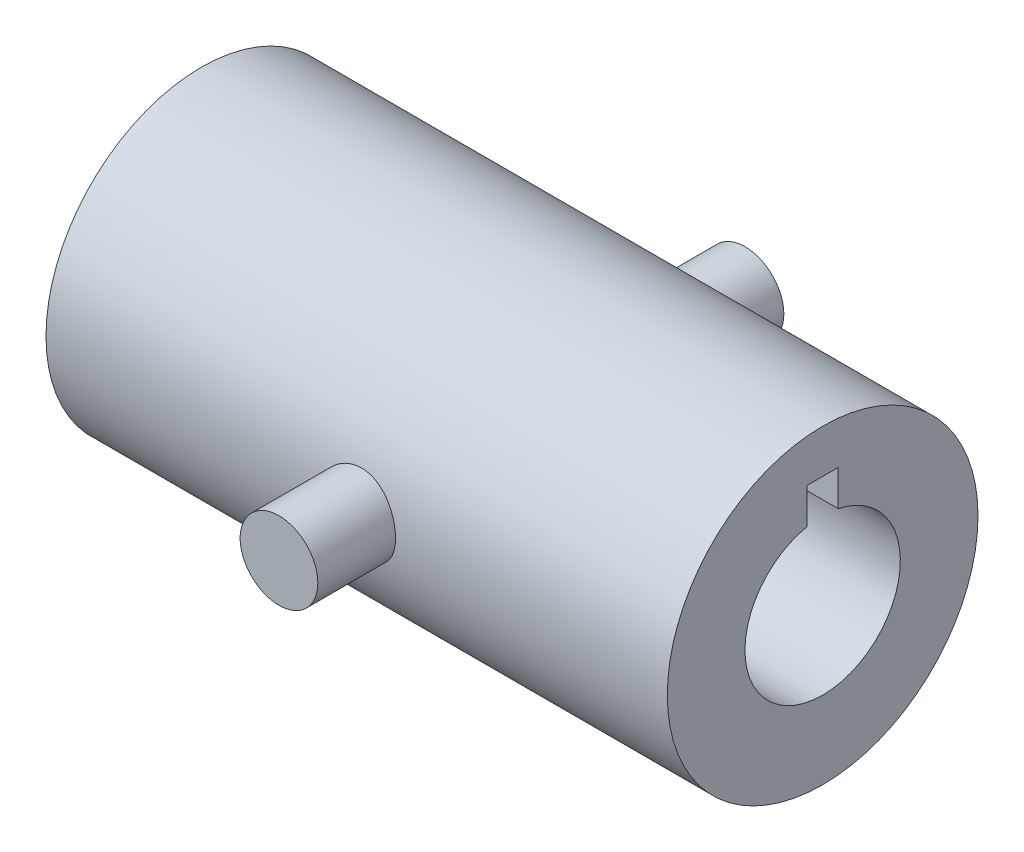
ISO-10303-21;
HEADER;
FILE_DESCRIPTION(('STEP AP214'),'2;1');
FILE_NAME('part.step','',(''),(''),'','','');
FILE_SCHEMA(('AUTOMOTIVE_DESIGN { 1 0 10303 214 1 1 1 1 }'));
ENDSEC;
DATA;
#1=APPLICATION_CONTEXT('core data for automotive mechanical design processes');
#2=APPLICATION_PROTOCOL_DEFINITION('international standard','automotive_design',2000,#1);
#3=PRODUCT_CONTEXT('',#1,'mechanical');
#4=PRODUCT('Part','Part','',(#3));
#5=PRODUCT_RELATED_PRODUCT_CATEGORY('part','',(#4));
#6=PRODUCT_DEFINITION_FORMATION('','',#4);
#7=PRODUCT_DEFINITION_CONTEXT('part definition',#1,'design');
#8=PRODUCT_DEFINITION('design','',#6,#7);
#9=PRODUCT_DEFINITION_SHAPE('','',#8);
#10=(LENGTH_UNIT() NAMED_UNIT(*) SI_UNIT(.MILLI.,.METRE.));
#11=(NAMED_UNIT(*) PLANE_ANGLE_UNIT() SI_UNIT($,.RADIAN.));
#12=(NAMED_UNIT(*) SI_UNIT($,.STERADIAN.) SOLID_ANGLE_UNIT());
#13=UNCERTAINTY_MEASURE_WITH_UNIT(LENGTH_MEASURE(1.E-05),#10,'distance_accuracy_value','');
#14=(GEOMETRIC_REPRESENTATION_CONTEXT(3) GLOBAL_UNCERTAINTY_ASSIGNED_CONTEXT((#13)) GLOBAL_UNIT_ASSIGNED_CONTEXT((#10,
#11,#12)) REPRESENTATION_CONTEXT('',''));
#15=CARTESIAN_POINT('',(0.,0.,0.));
#16=DIRECTION('',(0.,0.,1.));
#17=DIRECTION('',(1.,0.,0.));
#18=AXIS2_PLACEMENT_3D('',#15,#16,#17);
#19=CARTESIAN_POINT('',(12912.4668219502,5713.18508240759,-41.8213637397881));
#20=DIRECTION('',(-5.67598126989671E-05,-1.88587533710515E-05,0.999999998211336));
#21=DIRECTION('',(0.999999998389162,0.,5.67598127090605E-05));
#22=AXIS2_PLACEMENT_3D('',#19,#20,#21);
#23=PLANE('',#22);
#24=CARTESIAN_POINT('',(12909.2918221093,5713.18607137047,-41.8215439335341));
#25=DIRECTION('',(-5.67598127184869E-05,-1.8858753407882E-05,0.999999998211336));
#26=DIRECTION('',(0.999999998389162,0.,5.67598127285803E-05));
#27=AXIS2_PLACEMENT_3D('',#24,#25,#26);
#28=CIRCLE('',#27,3.17500000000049);
#29=CARTESIAN_POINT('',(12912.4668221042,5713.18607137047,-41.8213637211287));
#30=VERTEX_POINT('',#29);
#31=EDGE_CURVE('E39',#30,#30,#28,.T.);
#32=ORIENTED_EDGE('',*,*,#31,.F.);
#33=EDGE_LOOP('',(#32));
#34=FACE_BOUND('',#33,.T.);
#35=ADVANCED_FACE('F34',(#34),#23,.F.);
#36=CARTESIAN_POINT('',(12909.2918221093,5713.18607137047,-41.8215439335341));
#37=DIRECTION('',(-5.67598127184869E-05,-1.8858753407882E-05,0.999999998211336));
#38=DIRECTION('',(0.999999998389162,0.,5.67598127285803E-05));
#39=AXIS2_PLACEMENT_3D('',#36,#37,#38);
#40=CYLINDRICAL_SURFACE('',#39,3.17500000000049);
#41=CARTESIAN_POINT('',(12912.4664615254,5713.18496265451,-35.4713637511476));
#42=CARTESIAN_POINT('',(12912.4665085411,5713.36032179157,-35.4713559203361));
#43=CARTESIAN_POINT('',(12912.4519887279,5713.53578583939,-35.467688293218));
#44=CARTESIAN_POINT('',(12912.3942525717,5713.88174267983,-35.4534124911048));
#45=CARTESIAN_POINT('',(12912.3510083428,5714.05223047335,-35.4427975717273));
#46=CARTESIAN_POINT('',(12912.2372992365,5714.38311564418,-35.4158042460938));
#47=CARTESIAN_POINT('',(12912.166871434,5714.54352642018,-35.3994336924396));
#48=CARTESIAN_POINT('',(12912.0009154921,5714.85024110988,-35.3626735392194));
#49=CARTESIAN_POINT('',(12911.9053885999,5714.99654572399,-35.3422841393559));
#50=CARTESIAN_POINT('',(12911.6898614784,5715.27393102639,-35.2992288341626));
#51=CARTESIAN_POINT('',(12911.5694406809,5715.40467950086,-35.2765277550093));
#52=CARTESIAN_POINT('',(12911.3084420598,5715.64435269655,-35.2316417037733));
#53=CARTESIAN_POINT('',(12911.1678616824,5715.75327464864,-35.2094567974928));
#54=CARTESIAN_POINT('',(12910.8679613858,5715.94776124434,-35.167761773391));
#55=CARTESIAN_POINT('',(12910.7083941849,5716.03295501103,-35.1482962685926));
#56=CARTESIAN_POINT('',(12910.3766380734,5716.17518059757,-35.1147569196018));
#57=CARTESIAN_POINT('',(12910.2044512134,5716.23221698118,-35.1006822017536));
#58=CARTESIAN_POINT('',(12909.8559906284,5716.31537624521,-35.0798796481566));
#59=CARTESIAN_POINT('',(12909.6798678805,5716.34209553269,-35.0730102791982));
#60=CARTESIAN_POINT('',(12909.3255159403,5716.36572095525,-35.0669735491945));
#61=CARTESIAN_POINT('',(12909.1472870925,5716.362631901,-35.0678049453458));
#62=CARTESIAN_POINT('',(12908.7983547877,5716.32720278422,-35.0769491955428));
#63=CARTESIAN_POINT('',(12908.6275736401,5716.29557362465,-35.0850801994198));
#64=CARTESIAN_POINT('',(12908.2938215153,5716.20509719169,-35.107618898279));
#65=CARTESIAN_POINT('',(12908.1308511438,5716.14624781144,-35.1220270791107));
#66=CARTESIAN_POINT('',(12907.81543686,5716.00239423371,-35.1556650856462));
#67=CARTESIAN_POINT('',(12907.6631162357,5715.91713125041,-35.1749422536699));
#68=CARTESIAN_POINT('',(12907.3747002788,5715.72305727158,-35.2161185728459));
#69=CARTESIAN_POINT('',(12907.2386067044,5715.6142437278,-35.23801800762));
#70=CARTESIAN_POINT('',(12906.9824435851,5715.37249676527,-35.2827353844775));
#71=CARTESIAN_POINT('',(12906.8629375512,5715.23896711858,-35.3055617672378));
#72=CARTESIAN_POINT('',(12906.6478582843,5714.9534265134,-35.3490119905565));
#73=CARTESIAN_POINT('',(12906.5522953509,5714.80140764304,-35.3696348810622));
#74=CARTESIAN_POINT('',(12906.3876099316,5714.48235689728,-35.406460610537));
#75=CARTESIAN_POINT('',(12906.3185999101,5714.31526478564,-35.4226445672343));
#76=CARTESIAN_POINT('',(12906.2099349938,5713.97156011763,-35.4486068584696));
#77=CARTESIAN_POINT('',(12906.1702189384,5713.79496822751,-35.458398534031));
#78=CARTESIAN_POINT('',(12906.1360369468,5713.54525641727,-35.4668620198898));
#79=CARTESIAN_POINT('',(12906.128722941,5713.47381174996,-35.4686796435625));
#80=CARTESIAN_POINT('',(12906.1189447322,5713.33057005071,-35.4711110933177));
#81=CARTESIAN_POINT('',(12906.116480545,5713.25877301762,-35.4717249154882));
#82=CARTESIAN_POINT('',(12906.1164162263,5713.01172267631,-35.471722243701));
#83=CARTESIAN_POINT('',(12906.1309212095,5712.83629411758,-35.4680634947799));
#84=CARTESIAN_POINT('',(12906.1886289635,5712.49029931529,-35.4538007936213));
#85=CARTESIAN_POINT('',(12906.2318857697,5712.31974285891,-35.4431837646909));
#86=CARTESIAN_POINT('',(12906.3456246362,5711.98877020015,-35.4161821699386));
#87=CARTESIAN_POINT('',(12906.4160604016,5711.82833729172,-35.3998074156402));
#88=CARTESIAN_POINT('',(12906.5820181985,5711.52162222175,-35.3630390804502));
#89=CARTESIAN_POINT('',(12906.6775330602,5711.37533603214,-35.3426466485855));
#90=CARTESIAN_POINT('',(12906.8930292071,5711.09798258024,-35.299582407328));
#91=CARTESIAN_POINT('',(12907.0134309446,5710.96724744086,-35.2768753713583));
#92=CARTESIAN_POINT('',(12907.2744221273,5710.72756699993,-35.2319686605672));
#93=CARTESIAN_POINT('',(12907.4150188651,5710.61862960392,-35.209769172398));
#94=CARTESIAN_POINT('',(12907.7149997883,5710.42408121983,-35.1680341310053));
#95=CARTESIAN_POINT('',(12907.8746377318,5710.33885119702,-35.14854435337));
#96=CARTESIAN_POINT('',(12908.2064379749,5710.19664894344,-35.1149787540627));
#97=CARTESIAN_POINT('',(12908.3785853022,5710.13964354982,-35.1008965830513));
#98=CARTESIAN_POINT('',(12908.6747426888,5710.06895114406,-35.0831767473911));
#99=CARTESIAN_POINT('',(12908.7967908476,5710.04726986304,-35.0776452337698));
#100=CARTESIAN_POINT('',(12909.0426917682,5710.0182832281,-35.0702216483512));
#101=CARTESIAN_POINT('',(12909.1665444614,5710.01097732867,-35.0683294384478));
#102=CARTESIAN_POINT('',(12909.4657125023,5710.01089725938,-35.0683211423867));
#103=CARTESIAN_POINT('',(12909.6410805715,5710.02540147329,-35.0720952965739));
#104=CARTESIAN_POINT('',(12909.9868383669,5710.08307006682,-35.0867717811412));
#105=CARTESIAN_POINT('',(12910.1572230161,5710.12626268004,-35.0976811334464));
#106=CARTESIAN_POINT('',(12910.4878922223,5710.23982176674,-35.12531428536));
#107=CARTESIAN_POINT('',(12910.6481909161,5710.31014917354,-35.1420297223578));
#108=CARTESIAN_POINT('',(12910.9547125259,5710.47586664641,-35.179379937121));
#109=CARTESIAN_POINT('',(12911.1009363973,5710.57125500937,-35.2000144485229));
#110=CARTESIAN_POINT('',(12911.3783909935,5710.78662579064,-35.2433855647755));
#111=CARTESIAN_POINT('',(12911.5092676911,5710.90705761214,-35.2661556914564));
#112=CARTESIAN_POINT('',(12911.7492185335,5711.16816352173,-35.310946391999));
#113=CARTESIAN_POINT('',(12911.85828609,5711.30884370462,-35.3329667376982));
#114=CARTESIAN_POINT('',(12912.0529788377,5711.60890682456,-35.3741507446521));
#115=CARTESIAN_POINT('',(12912.138244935,5711.76852930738,-35.3932688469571));
#116=CARTESIAN_POINT('',(12912.2805190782,5712.10029704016,-35.4260797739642));
#117=CARTESIAN_POINT('',(12912.3375596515,5712.27242761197,-35.4397788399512));
#118=CARTESIAN_POINT('',(12912.4083447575,5712.5686769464,-35.4569925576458));
#119=CARTESIAN_POINT('',(12912.4300674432,5712.69084181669,-35.4623559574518));
#120=CARTESIAN_POINT('',(12912.4591089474,5712.93697456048,-35.4695442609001));
#121=CARTESIAN_POINT('',(12912.4664282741,5713.06094237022,-35.4713692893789));
#122=CARTESIAN_POINT('',(12912.4664615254,5713.18496265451,-35.4713637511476));
#123=B_SPLINE_CURVE_WITH_KNOTS('',3,(#41,#42,#43,#44,#45,#46,#47,#48,#49,#50,#51,#52,#53,#54,
#55,#56,#57,#58,#59,#60,#61,#62,#63,#64,#65,#66,#67,#68,#69,#70,#71,#72,#73,#74,#75,#76,#77,#78,
#79,#80,#81,#82,#83,#84,#85,#86,#87,#88,#89,#90,#91,#92,#93,#94,#95,#96,#97,#98,#99,#100,#101,
#102,#103,#104,#105,#106,#107,#108,#109,#110,#111,#112,#113,#114,#115,#116,#117,#118,#119,#120,
#121,#122),.UNSPECIFIED.,.T.,.F.,(4,2,2,2,2,2,2,2,2,2,2,2,2,2,2,2,2,2,2,2,2,2,2,2,2,2,2,2,2,2,2,
2,2,2,2,2,2,2,2,2,4),(0.,0.52561787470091,1.05174677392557,1.57716062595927,2.10254837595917,
2.63766848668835,3.17285644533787,3.715991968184,4.25903943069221,4.79120789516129,
5.32329047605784,5.84247458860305,6.36169889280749,6.88618036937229,7.41071862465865,
7.95012418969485,8.48976139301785,9.03165969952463,9.57242338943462,9.78780709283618,
10.0031914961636,10.5285697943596,11.0549382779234,11.5804141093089,12.1057398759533,
12.6407970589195,13.1760479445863,13.7194594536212,14.2622309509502,14.6336358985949,
15.0050267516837,15.5303546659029,16.0562003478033,16.5812917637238,17.1063475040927,
17.6417952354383,18.1774044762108,18.720704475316,19.2633769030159,19.6351258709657,
20.0068617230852),.UNSPECIFIED.);
#124=CARTESIAN_POINT('',(12912.4664615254,5713.18496265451,-35.4713637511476));
#125=VERTEX_POINT('',#124);
#126=EDGE_CURVE('E97',#125,#125,#123,.T.);
#127=ORIENTED_EDGE('',*,*,#126,.F.);
#128=EDGE_LOOP('',(#127));
#129=FACE_BOUND('',#128,.T.);
#130=ORIENTED_EDGE('',*,*,#31,.T.);
#131=EDGE_LOOP('',(#130));
#132=FACE_BOUND('',#131,.T.);
#133=ADVANCED_FACE('F106',(#129,#132),#40,.T.);
#134=CARTESIAN_POINT('',(12883.8923314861,5718.52761982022,-21.5029697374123));
#135=DIRECTION('',(-5.67548546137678E-05,-2.94111732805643E-06,0.999999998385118));
#136=DIRECTION('',(0.999999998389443,0.,5.67548546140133E-05));
#137=AXIS2_PLACEMENT_3D('',#134,#135,#136);
#138=PLANE('',#137);
#139=DIRECTION('',(0.999999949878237,-0.000311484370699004,5.6753935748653E-05));
#140=VECTOR('',#139,1.);
#141=CARTESIAN_POINT('',(12946.1096443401,5719.39594408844,-21.4994360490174));
#142=LINE('',#141,#140);
#143=CARTESIAN_POINT('',(12934.6926054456,5719.39950031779,-21.5000840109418));
#144=VERTEX_POINT('',#143);
#145=CARTESIAN_POINT('',(12883.8926079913,5719.41532284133,-21.5029627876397));
#146=VERTEX_POINT('',#145);
#147=EDGE_CURVE('E79',#144,#146,#142,.F.);
#148=ORIENTED_EDGE('',*,*,#147,.T.);
#149=DIRECTION('',(-0.000311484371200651,-0.999999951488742,0.));
#150=VECTOR('',#149,1.);
#151=CARTESIAN_POINT('',(12883.8926479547,5719.54362352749,-21.5029584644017));
#152=LINE('',#151,#150);
#153=CARTESIAN_POINT('',(12883.8935182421,5722.33762339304,-21.5029584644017));
#154=VERTEX_POINT('',#153);
#155=EDGE_CURVE('E73',#154,#146,#152,.T.);
#156=ORIENTED_EDGE('',*,*,#155,.F.);
#157=DIRECTION('',(0.999999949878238,-0.000311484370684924,5.67539357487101E-05));
#158=VECTOR('',#157,1.);
#159=CARTESIAN_POINT('',(12883.8935182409,5722.33761963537,-21.5029584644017));
#160=LINE('',#159,#158);
#161=CARTESIAN_POINT('',(12934.6935156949,5722.32179622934,-21.5000796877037));
#162=VERTEX_POINT('',#161);
#163=EDGE_CURVE('E143',#154,#162,#160,.T.);
#164=ORIENTED_EDGE('',*,*,#163,.T.);
#165=DIRECTION('',(0.000311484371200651,0.999999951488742,0.));
#166=VECTOR('',#165,1.);
#167=CARTESIAN_POINT('',(12934.692645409,5719.52780012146,-21.5000840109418));
#168=LINE('',#167,#166);
#169=EDGE_CURVE('E89',#144,#162,#168,.T.);
#170=ORIENTED_EDGE('',*,*,#169,.F.);
#171=EDGE_LOOP('',(#148,#156,#164,#170));
#172=FACE_BOUND('',#171,.T.);
#173=ADVANCED_FACE('F87',(#172),#138,.F.);
#174=CARTESIAN_POINT('',(12883.8935182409,5722.33761963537,-21.5029584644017));
#175=DIRECTION('',(0.000311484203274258,0.999999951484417,2.95879543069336E-06));
#176=DIRECTION('',(-0.999999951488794,0.000311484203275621,0.));
#177=AXIS2_PLACEMENT_3D('',#174,#175,#176);
#178=PLANE('',#177);
#179=ORIENTED_EDGE('',*,*,#163,.F.);
#180=DIRECTION('',(-5.67539329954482E-05,1.76779639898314E-08,0.999999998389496));
#181=VECTOR('',#180,1.);
#182=CARTESIAN_POINT('',(12883.8935903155,5722.33762712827,-22.7728656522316));
#183=LINE('',#182,#181);
#184=CARTESIAN_POINT('',(12883.8936623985,5722.33762710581,-24.042962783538));
#185=VERTEX_POINT('',#184);
#186=EDGE_CURVE('E94',#185,#154,#183,.T.);
#187=ORIENTED_EDGE('',*,*,#186,.F.);
#188=DIRECTION('',(0.999999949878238,-0.000311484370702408,5.67539357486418E-05));
#189=VECTOR('',#188,1.);
#190=CARTESIAN_POINT('',(12883.8936623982,5722.33762710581,-24.0429584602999));
#191=LINE('',#190,#189);
#192=CARTESIAN_POINT('',(12934.6936598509,5722.32179994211,-24.0400753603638));
#193=VERTEX_POINT('',#192);
#194=EDGE_CURVE('E161',#185,#193,#191,.T.);
#195=ORIENTED_EDGE('',*,*,#194,.T.);
#196=DIRECTION('',(-5.67539329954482E-05,1.76779639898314E-08,0.999999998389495));
#197=VECTOR('',#196,1.);
#198=CARTESIAN_POINT('',(12934.6935877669,5722.32179620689,-22.7699825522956));
#199=LINE('',#198,#197);
#200=EDGE_CURVE('E104',#162,#193,#199,.F.);
#201=ORIENTED_EDGE('',*,*,#200,.F.);
#202=EDGE_LOOP('',(#179,#187,#195,#201));
#203=FACE_BOUND('',#202,.T.);
#204=ADVANCED_FACE('F114',(#203),#178,.F.);
#205=CARTESIAN_POINT('',(12883.8936623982,5722.33762710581,-24.0429584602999));
#206=DIRECTION('',(5.67548546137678E-05,2.94111732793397E-06,-0.999999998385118));
#207=DIRECTION('',(-0.999999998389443,0.,-5.67548546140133E-05));
#208=AXIS2_PLACEMENT_3D('',#205,#206,#207);
#209=PLANE('',#208);
#210=ORIENTED_EDGE('',*,*,#194,.F.);
#211=DIRECTION('',(-0.000311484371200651,-0.999999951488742,0.));
#212=VECTOR('',#211,1.);
#213=CARTESIAN_POINT('',(12883.8927921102,5719.54362348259,-24.0429671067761));
#214=LINE('',#213,#212);
#215=CARTESIAN_POINT('',(12883.8927521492,5719.41533119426,-24.0429671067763));
#216=VERTEX_POINT('',#215);
#217=EDGE_CURVE('E84',#216,#185,#214,.F.);
#218=ORIENTED_EDGE('',*,*,#217,.F.);
#219=DIRECTION('',(0.999999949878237,-0.000311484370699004,5.6753935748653E-05));
#220=VECTOR('',#219,1.);
#221=CARTESIAN_POINT('',(12946.1097884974,5719.39595155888,-24.0394360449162));
#222=LINE('',#221,#220);
#223=CARTESIAN_POINT('',(12934.692749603,5719.39950867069,-24.0400796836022));
#224=VERTEX_POINT('',#223);
#225=EDGE_CURVE('E80',#216,#224,#222,.T.);
#226=ORIENTED_EDGE('',*,*,#225,.T.);
#227=DIRECTION('',(0.000311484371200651,0.999999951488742,0.));
#228=VECTOR('',#227,1.);
#229=CARTESIAN_POINT('',(12934.6927895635,5719.52780007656,-24.0400753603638));
#230=LINE('',#229,#228);
#231=EDGE_CURVE('E153',#193,#224,#230,.F.);
#232=ORIENTED_EDGE('',*,*,#231,.F.);
#233=EDGE_LOOP('',(#210,#218,#226,#232));
#234=FACE_BOUND('',#233,.T.);
#235=ADVANCED_FACE('F117',(#234),#209,.F.);
#236=CARTESIAN_POINT('',(12883.890742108,5713.19362381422,-22.7729855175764));
#237=DIRECTION('',(0.999999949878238,-0.000311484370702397,5.67539357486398E-05));
#238=DIRECTION('',(0.000311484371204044,0.999999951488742,0.));
#239=AXIS2_PLACEMENT_3D('',#236,#237,#238);
#240=CYLINDRICAL_SURFACE('',#239,6.35);
#241=CARTESIAN_POINT('',(12883.890742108,5713.19362381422,-22.7729855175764));
#242=DIRECTION('',(0.999999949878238,-0.000311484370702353,5.67539357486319E-05));
#243=DIRECTION('',(0.000311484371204,0.999999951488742,0.));
#244=AXIS2_PLACEMENT_3D('',#241,#242,#243);
#245=CIRCLE('',#244,6.35);
#246=EDGE_CURVE('E77',#146,#216,#245,.T.);
#247=ORIENTED_EDGE('',*,*,#246,.F.);
#248=ORIENTED_EDGE('',*,*,#147,.F.);
#249=CARTESIAN_POINT('',(12934.6907395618,5713.17780040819,-22.7701024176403));
#250=DIRECTION('',(0.999999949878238,-0.000311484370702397,5.67539357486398E-05));
#251=DIRECTION('',(0.000311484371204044,0.999999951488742,0.));
#252=AXIS2_PLACEMENT_3D('',#249,#250,#251);
#253=CIRCLE('',#252,6.35);
#254=EDGE_CURVE('E54',#224,#144,#253,.F.);
#255=ORIENTED_EDGE('',*,*,#254,.F.);
#256=ORIENTED_EDGE('',*,*,#225,.F.);
#257=EDGE_LOOP('',(#247,#248,#255,#256));
#258=FACE_BOUND('',#257,.T.);
#259=ADVANCED_FACE('F78',(#258),#240,.F.);
#260=CARTESIAN_POINT('',(12912.4646594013,5713.18436388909,-3.72136380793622));
#261=DIRECTION('',(-5.67598126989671E-05,-1.88587533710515E-05,0.999999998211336));
#262=DIRECTION('',(0.999999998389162,0.,5.67598127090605E-05));
#263=AXIS2_PLACEMENT_3D('',#260,#261,#262);
#264=PLANE('',#263);
#265=CARTESIAN_POINT('',(12909.2896595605,5713.18535285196,-3.72154400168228));
#266=DIRECTION('',(-5.6759812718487E-05,-1.8858753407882E-05,0.999999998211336));
#267=DIRECTION('',(0.999999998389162,0.,5.67598127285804E-05));
#268=AXIS2_PLACEMENT_3D('',#265,#266,#267);
#269=CIRCLE('',#268,3.17500000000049);
#270=CARTESIAN_POINT('',(12912.4646595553,5713.18535285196,-3.72136378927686));
#271=VERTEX_POINT('',#270);
#272=EDGE_CURVE('E150',#271,#271,#269,.F.);
#273=ORIENTED_EDGE('',*,*,#272,.F.);
#274=EDGE_LOOP('',(#273));
#275=FACE_BOUND('',#274,.T.);
#276=ADVANCED_FACE('F124',(#275),#264,.T.);
#277=CARTESIAN_POINT('',(12883.892720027,5719.54362350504,-22.7728656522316));
#278=DIRECTION('',(-0.999999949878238,0.000311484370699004,-5.67539357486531E-05));
#279=DIRECTION('',(-0.000311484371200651,-0.999999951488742,0.));
#280=AXIS2_PLACEMENT_3D('',#277,#278,#279);
#281=PLANE('',#280);
#282=CARTESIAN_POINT('',(12883.890742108,5713.19362381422,-22.7729855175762));
#283=DIRECTION('',(0.999999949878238,-0.000311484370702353,5.67539357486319E-05));
#284=DIRECTION('',(0.000311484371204,0.999999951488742,0.));
#285=AXIS2_PLACEMENT_3D('',#282,#283,#284);
#286=CIRCLE('',#285,12.7000000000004);
#287=CARTESIAN_POINT('',(12883.8946979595,5725.89362319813,-22.7729855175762));
#288=VERTEX_POINT('',#287);
#289=EDGE_CURVE('E147',#288,#288,#286,.T.);
#290=ORIENTED_EDGE('',*,*,#289,.F.);
#291=EDGE_LOOP('',(#290));
#292=FACE_BOUND('',#291,.T.);
#293=ORIENTED_EDGE('',*,*,#217,.T.);
#294=ORIENTED_EDGE('',*,*,#186,.T.);
#295=ORIENTED_EDGE('',*,*,#155,.T.);
#296=ORIENTED_EDGE('',*,*,#246,.T.);
#297=EDGE_LOOP('',(#293,#294,#295,#296));
#298=FACE_BOUND('',#297,.T.);
#299=ADVANCED_FACE('F92',(#292,#298),#281,.T.);
#300=CARTESIAN_POINT('',(12934.6927174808,5719.52780009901,-22.7699825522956));
#301=DIRECTION('',(0.999999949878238,-0.000311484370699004,5.67539357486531E-05));
#302=DIRECTION('',(0.000311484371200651,0.999999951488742,0.));
#303=AXIS2_PLACEMENT_3D('',#300,#301,#302);
#304=PLANE('',#303);
#305=ORIENTED_EDGE('',*,*,#231,.T.);
#306=ORIENTED_EDGE('',*,*,#254,.T.);
#307=ORIENTED_EDGE('',*,*,#169,.T.);
#308=ORIENTED_EDGE('',*,*,#200,.T.);
#309=EDGE_LOOP('',(#305,#306,#307,#308));
#310=FACE_BOUND('',#309,.T.);
#311=CARTESIAN_POINT('',(12934.6907395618,5713.17780040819,-22.7701024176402));
#312=DIRECTION('',(0.999999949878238,-0.000311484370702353,5.67539357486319E-05));
#313=DIRECTION('',(0.000311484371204,0.999999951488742,0.));
#314=AXIS2_PLACEMENT_3D('',#311,#312,#313);
#315=CIRCLE('',#314,12.7000000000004);
#316=CARTESIAN_POINT('',(12934.6946954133,5725.8777997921,-22.7701024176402));
#317=VERTEX_POINT('',#316);
#318=EDGE_CURVE('E45',#317,#317,#315,.F.);
#319=ORIENTED_EDGE('',*,*,#318,.F.);
#320=EDGE_LOOP('',(#319));
#321=FACE_BOUND('',#320,.T.);
#322=ADVANCED_FACE('F130',(#310,#321),#304,.T.);
#323=CARTESIAN_POINT('',(12909.2900451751,5713.18548097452,-10.515341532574));
#324=DIRECTION('',(-5.6759812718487E-05,-1.8858753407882E-05,0.999999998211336));
#325=DIRECTION('',(0.999999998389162,0.,5.67598127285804E-05));
#326=AXIS2_PLACEMENT_3D('',#323,#324,#325);
#327=CYLINDRICAL_SURFACE('',#326,3.17500000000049);
#328=ORIENTED_EDGE('',*,*,#272,.T.);
#329=EDGE_LOOP('',(#328));
#330=FACE_BOUND('',#329,.T.);
#331=CARTESIAN_POINT('',(12909.2890539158,5710.01048036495,-10.4748817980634));
#332=CARTESIAN_POINT('',(12909.1137912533,5710.01054264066,-10.4748866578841));
#333=CARTESIAN_POINT('',(12908.9384322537,5710.02515595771,-10.4711119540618));
#334=CARTESIAN_POINT('',(12908.5927104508,5710.08303938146,-10.4564332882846));
#335=CARTESIAN_POINT('',(12908.4223527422,5710.12633771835,-10.4455223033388));
#336=CARTESIAN_POINT('',(12908.0917543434,5710.24010173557,-10.4178848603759));
#337=CARTESIAN_POINT('',(12907.931499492,5710.31052835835,-10.4011667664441));
#338=CARTESIAN_POINT('',(12907.6250811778,5710.47643534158,-10.3638102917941));
#339=CARTESIAN_POINT('',(12907.4789167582,5710.57191399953,-10.3431721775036));
#340=CARTESIAN_POINT('',(12907.2015963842,5710.78745594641,-10.2997929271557));
#341=CARTESIAN_POINT('',(12907.0707947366,5710.90796841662,-10.2770182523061));
#342=CARTESIAN_POINT('',(12906.8310066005,5711.16922206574,-10.2322176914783));
#343=CARTESIAN_POINT('',(12906.722026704,5711.30996933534,-10.2101920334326));
#344=CARTESIAN_POINT('',(12906.5275209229,5711.6101521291,-10.1689966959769));
#345=CARTESIAN_POINT('',(12906.4423542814,5711.769826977,-10.149872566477));
#346=CARTESIAN_POINT('',(12906.3002868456,5712.10168203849,-10.1170491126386));
#347=CARTESIAN_POINT('',(12906.2433535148,5712.27384759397,-10.1033435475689));
#348=CARTESIAN_POINT('',(12906.1727529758,5712.57014031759,-10.0861186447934));
#349=CARTESIAN_POINT('',(12906.1511063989,5712.69231849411,-10.0807506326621));
#350=CARTESIAN_POINT('',(12906.1222182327,5712.93846901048,-10.0735530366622));
#351=CARTESIAN_POINT('',(12906.1149761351,5713.06244128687,-10.0717233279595));
#352=CARTESIAN_POINT('',(12906.1150823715,5713.36182070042,-10.0717253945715));
#353=CARTESIAN_POINT('',(12906.1297114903,5713.53727580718,-10.0753863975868));
#354=CARTESIAN_POINT('',(12906.1876631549,5713.88319715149,-10.0896491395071));
#355=CARTESIAN_POINT('',(12906.2310135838,5714.05365837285,-10.1002576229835));
#356=CARTESIAN_POINT('',(12906.3449287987,5714.38447366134,-10.1272384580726));
#357=CARTESIAN_POINT('',(12906.4154565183,5714.54484114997,-10.1436029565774));
#358=CARTESIAN_POINT('',(12906.5816035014,5714.85145378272,-10.1803515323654));
#359=CARTESIAN_POINT('',(12906.6772215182,5714.99769962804,-10.2007354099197));
#360=CARTESIAN_POINT('',(12906.8929214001,5715.27495223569,-10.2437802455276));
#361=CARTESIAN_POINT('',(12907.0134236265,5715.40562652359,-10.2664763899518));
#362=CARTESIAN_POINT('',(12907.2745715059,5715.64513877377,-10.3113533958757));
#363=CARTESIAN_POINT('',(12907.415219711,5715.75397396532,-10.3335341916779));
#364=CARTESIAN_POINT('',(12907.7152411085,5715.94827526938,-10.3752218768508));
#365=CARTESIAN_POINT('',(12907.8748613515,5716.03337034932,-10.3946841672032));
#366=CARTESIAN_POINT('',(12908.2067060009,5716.17539050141,-10.4282181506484));
#367=CARTESIAN_POINT('',(12908.3789283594,5716.23232013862,-10.4422907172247));
#368=CARTESIAN_POINT('',(12908.7274406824,5716.31526309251,-10.4630901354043));
#369=CARTESIAN_POINT('',(12908.9035800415,5716.34187291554,-10.4699584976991));
#370=CARTESIAN_POINT('',(12909.2579466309,5716.36527781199,-10.4759943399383));
#371=CARTESIAN_POINT('',(12909.4361735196,5716.36207769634,-10.4751630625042));
#372=CARTESIAN_POINT('',(12909.7850836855,5716.32643086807,-10.4660201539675));
#373=CARTESIAN_POINT('',(12909.955845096,5716.29469501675,-10.4578903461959));
#374=CARTESIAN_POINT('',(12910.2895407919,5716.20400983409,-10.4353550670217));
#375=CARTESIAN_POINT('',(12910.4524744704,5716.14505839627,-10.4209491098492));
#376=CARTESIAN_POINT('',(12910.7677990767,5716.00100708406,-10.3873165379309));
#377=CARTESIAN_POINT('',(12910.9200665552,5715.91564849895,-10.3680425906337));
#378=CARTESIAN_POINT('',(12911.208361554,5715.72139332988,-10.3268736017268));
#379=CARTESIAN_POINT('',(12911.3443873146,5715.61249419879,-10.3049782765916));
#380=CARTESIAN_POINT('',(12911.6003997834,5715.37058601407,-10.2602700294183));
#381=CARTESIAN_POINT('',(12911.7198226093,5715.23698108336,-10.2374486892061));
#382=CARTESIAN_POINT('',(12911.9347239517,5714.95130490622,-10.1940092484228));
#383=CARTESIAN_POINT('',(12912.0301921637,5714.79922575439,-10.1733920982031));
#384=CARTESIAN_POINT('',(12912.1946787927,5714.48007108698,-10.1365784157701));
#385=CARTESIAN_POINT('',(12912.2635847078,5714.31293540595,-10.1204007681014));
#386=CARTESIAN_POINT('',(12912.3720354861,5713.96916213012,-10.0944514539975));
#387=CARTESIAN_POINT('',(12912.4116415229,5713.79254516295,-10.0846664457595));
#388=CARTESIAN_POINT('',(12912.4456679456,5713.54281178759,-10.0762123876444));
#389=CARTESIAN_POINT('',(12912.4529374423,5713.4713625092,-10.0743974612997));
#390=CARTESIAN_POINT('',(12912.4626264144,5713.32811465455,-10.0719714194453));
#391=CARTESIAN_POINT('',(12912.465045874,5713.25631607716,-10.0713603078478));
#392=CARTESIAN_POINT('',(12912.4649562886,5713.009265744,-10.0713723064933));
#393=CARTESIAN_POINT('',(12912.4503420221,5712.83384639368,-10.0750376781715));
#394=CARTESIAN_POINT('',(12912.3924187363,5712.48788814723,-10.0893134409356));
#395=CARTESIAN_POINT('',(12912.3490556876,5712.31735907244,-10.0999369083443));
#396=CARTESIAN_POINT('',(12912.2351106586,5711.98645835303,-10.1269509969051));
#397=CARTESIAN_POINT('',(12912.1645749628,5711.82606997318,-10.1433318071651));
#398=CARTESIAN_POINT('',(12911.9984261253,5711.51945973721,-10.1801117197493));
#399=CARTESIAN_POINT('',(12911.9028201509,5711.37323384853,-10.2005096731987));
#400=CARTESIAN_POINT('',(12911.6871512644,5711.09601632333,-10.2435843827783));
#401=CARTESIAN_POINT('',(12911.5666681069,5710.96535707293,-10.2662963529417));
#402=CARTESIAN_POINT('',(12911.3055276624,5710.72584096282,-10.3112121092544));
#403=CARTESIAN_POINT('',(12911.1648630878,5710.61699201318,-10.333415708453));
#404=CARTESIAN_POINT('',(12910.8647610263,5710.4226321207,-10.3751580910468));
#405=CARTESIAN_POINT('',(12910.7050700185,5710.33750229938,-10.3946510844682));
#406=CARTESIAN_POINT('',(12910.3731812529,5710.19550804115,-10.4282220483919));
#407=CARTESIAN_POINT('',(12910.2009984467,5710.13861043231,-10.4423063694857));
#408=CARTESIAN_POINT('',(12909.9047970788,5710.06810320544,-10.4600288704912));
#409=CARTESIAN_POINT('',(12909.7827354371,5710.04649816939,-10.4655612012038));
#410=CARTESIAN_POINT('',(12909.5368165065,5710.01766500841,-10.4729858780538));
#411=CARTESIAN_POINT('',(12909.4129592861,5710.01043633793,-10.4748783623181));
#412=CARTESIAN_POINT('',(12909.2890539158,5710.01048036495,-10.4748817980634));
#413=B_SPLINE_CURVE_WITH_KNOTS('',3,(#331,#332,#333,#334,#335,#336,#337,#338,#339,#340,#341,
#342,#343,#344,#345,#346,#347,#348,#349,#350,#351,#352,#353,#354,#355,#356,#357,#358,#359,#360,
#361,#362,#363,#364,#365,#366,#367,#368,#369,#370,#371,#372,#373,#374,#375,#376,#377,#378,#379,
#380,#381,#382,#383,#384,#385,#386,#387,#388,#389,#390,#391,#392,#393,#394,#395,#396,#397,#398,
#399,#400,#401,#402,#403,#404,#405,#406,#407,#408,#409,#410,#411,#412),.UNSPECIFIED.,.T.,.F.,(4,
2,2,2,2,2,2,2,2,2,2,2,2,2,2,2,2,2,2,2,2,2,2,2,2,2,2,2,2,2,2,2,2,2,2,2,2,2,2,2,4),(0.,
0.525327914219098,1.05117359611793,1.57626501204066,2.10132075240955,2.63676848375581,
3.1723777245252,3.71567772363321,4.25835015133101,4.63009911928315,5.00183497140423,
5.52745284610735,6.05358174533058,6.57899559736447,7.10438334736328,7.6395034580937,
8.17469141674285,8.71782693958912,9.26087440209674,9.79304286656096,10.3251254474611,
10.8443095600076,11.3635338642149,11.8880153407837,12.4125535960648,12.9519591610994,
13.4915963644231,14.0334946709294,14.574258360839,14.7896420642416,15.0050264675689,
15.5304047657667,16.05677324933,16.5822490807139,17.107574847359,17.6426320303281,
18.1778829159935,18.7212944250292,19.2640659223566,19.6354708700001,20.0068617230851),.UNSPECIFIED.);
#414=CARTESIAN_POINT('',(12909.2890539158,5710.01048036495,-10.4748817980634));
#415=VERTEX_POINT('',#414);
#416=EDGE_CURVE('E11',#415,#415,#413,.T.);
#417=ORIENTED_EDGE('',*,*,#416,.F.);
#418=EDGE_LOOP('',(#417));
#419=FACE_BOUND('',#418,.T.);
#420=ADVANCED_FACE('F133',(#330,#419),#327,.T.);
#421=CARTESIAN_POINT('',(12883.890742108,5713.19362381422,-22.7729855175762));
#422=DIRECTION('',(0.999999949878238,-0.000311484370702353,5.67539357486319E-05));
#423=DIRECTION('',(0.000311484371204,0.999999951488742,0.));
#424=AXIS2_PLACEMENT_3D('',#421,#422,#423);
#425=CYLINDRICAL_SURFACE('',#424,12.7000000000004);
#426=ORIENTED_EDGE('',*,*,#289,.T.);
#427=EDGE_LOOP('',(#426));
#428=FACE_BOUND('',#427,.T.);
#429=ORIENTED_EDGE('',*,*,#416,.T.);
#430=EDGE_LOOP('',(#429));
#431=FACE_BOUND('',#430,.T.);
#432=ORIENTED_EDGE('',*,*,#318,.T.);
#433=EDGE_LOOP('',(#432));
#434=FACE_BOUND('',#433,.T.);
#435=ORIENTED_EDGE('',*,*,#126,.T.);
#436=EDGE_LOOP('',(#435));
#437=FACE_BOUND('',#436,.T.);
#438=ADVANCED_FACE('F36',(#428,#431,#434,#437),#425,.T.);
#439=CLOSED_SHELL('',(#35,#133,#173,#204,#235,#259,#276,#299,#322,#420,#438));
#440=MANIFOLD_SOLID_BREP('B2',#439);
#441=ADVANCED_BREP_SHAPE_REPRESENTATION('',(#18,#440),#14);
#442=SHAPE_DEFINITION_REPRESENTATION(#9,#441);
ENDSEC;
END-ISO-10303-21;
